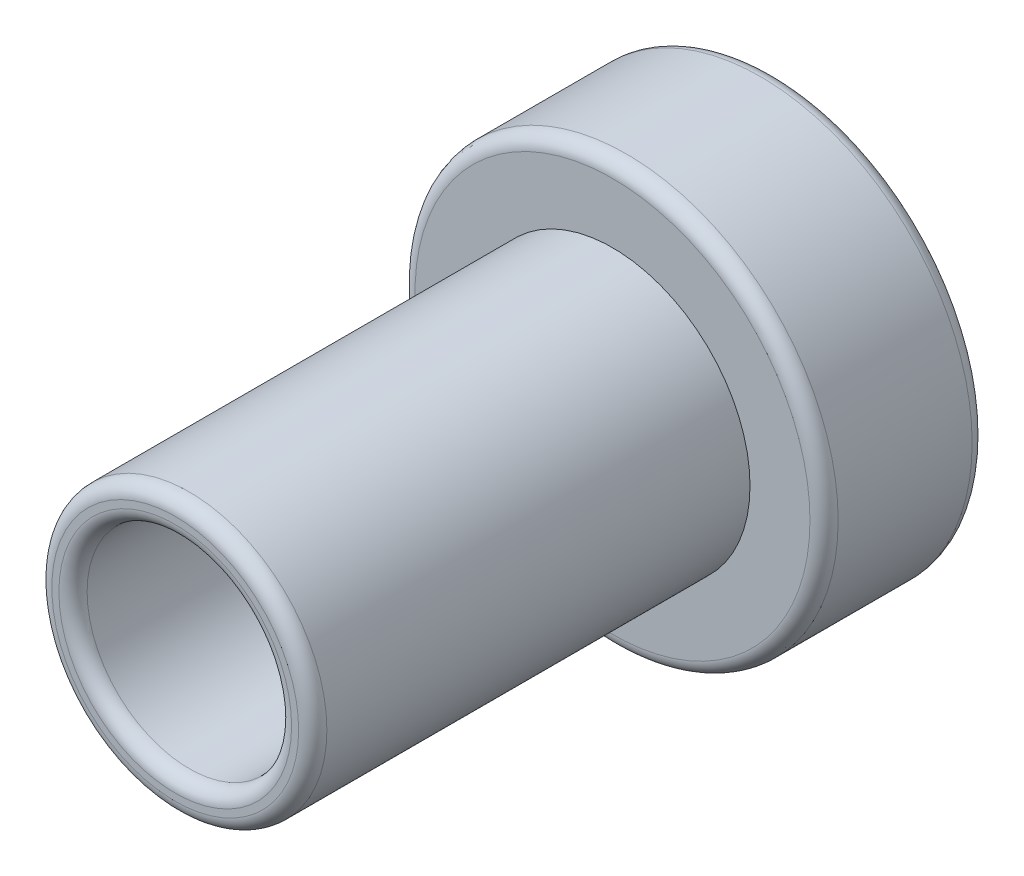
from build123d import *

# Parameters (mm, degrees)
ESQUISSE1_R             = 3
EXTRUSION1_DEPTH        = 2.3
ESQUISSE2_R             = 1.95
EXTRUSION2_DEPTH        = 6.2
ESQUISSE4_R             = 1.45
ENL_V_MAT_EXTRU_1_DEPTH = 10.5
CONG_1_R                = 0.2


with BuildPart() as part:
    # Esquisse1 → Extrusion1 (new body)
    with BuildSketch(Plane.XY):
        Circle(ESQUISSE1_R)
    extrude(amount=EXTRUSION1_DEPTH)

    # Esquisse2 → Extrusion2 (add)
    with BuildSketch(Plane.XY.offset(2.3)):
        with Locations(Location((0, 0, 0), (0, 0, 180))):
            Circle(ESQUISSE2_R)
    extrude(amount=EXTRUSION2_DEPTH)

    # Esquisse4 → Enl_v. mat.-Extru.1 (cut, through all)
    with BuildSketch(Plane.XY.offset(8.5)):
        Circle(ESQUISSE4_R)
    extrude(amount=-ENL_V_MAT_EXTRU_1_DEPTH, mode=Mode.SUBTRACT)

    # Cong_1
    cong_1_edges = [part.edges().sort_by_distance(p)[0] for p in [
        (-1.45, 0, 0),
        (-1.45, 0, 8.5),
        (-3, 0, 0),
        (-3, 0, 2.3),
        (1.95, 0, 8.5),
    ]]
    fillet(cong_1_edges, radius=CONG_1_R)


solid = part.part
